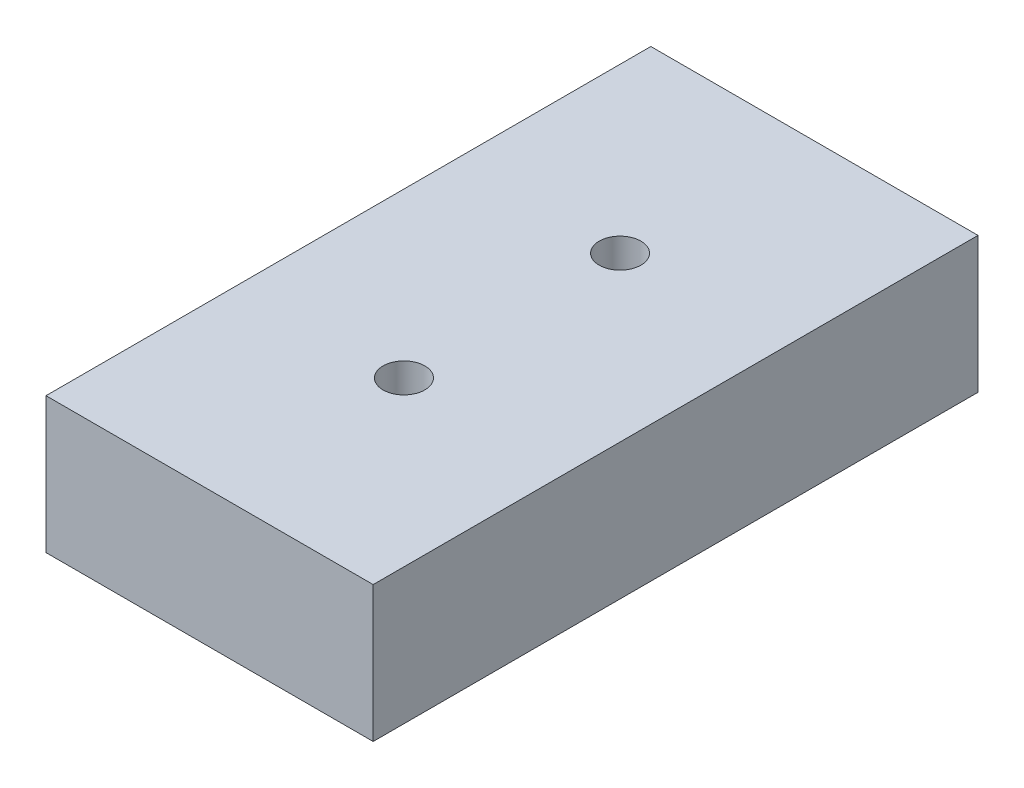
ISO-10303-21;
HEADER;
FILE_DESCRIPTION(('STEP AP214'),'2;1');
FILE_NAME('part.step','',(''),(''),'','','');
FILE_SCHEMA(('AUTOMOTIVE_DESIGN { 1 0 10303 214 1 1 1 1 }'));
ENDSEC;
DATA;
#1=APPLICATION_CONTEXT('core data for automotive mechanical design processes');
#2=APPLICATION_PROTOCOL_DEFINITION('international standard','automotive_design',2000,#1);
#3=PRODUCT_CONTEXT('',#1,'mechanical');
#4=PRODUCT('Part','Part','',(#3));
#5=PRODUCT_RELATED_PRODUCT_CATEGORY('part','',(#4));
#6=PRODUCT_DEFINITION_FORMATION('','',#4);
#7=PRODUCT_DEFINITION_CONTEXT('part definition',#1,'design');
#8=PRODUCT_DEFINITION('design','',#6,#7);
#9=PRODUCT_DEFINITION_SHAPE('','',#8);
#10=(LENGTH_UNIT() NAMED_UNIT(*) SI_UNIT(.MILLI.,.METRE.));
#11=(NAMED_UNIT(*) PLANE_ANGLE_UNIT() SI_UNIT($,.RADIAN.));
#12=(NAMED_UNIT(*) SI_UNIT($,.STERADIAN.) SOLID_ANGLE_UNIT());
#13=UNCERTAINTY_MEASURE_WITH_UNIT(LENGTH_MEASURE(1.E-05),#10,'distance_accuracy_value','');
#14=(GEOMETRIC_REPRESENTATION_CONTEXT(3) GLOBAL_UNCERTAINTY_ASSIGNED_CONTEXT((#13)) GLOBAL_UNIT_ASSIGNED_CONTEXT((#10,
#11,#12)) REPRESENTATION_CONTEXT('',''));
#15=CARTESIAN_POINT('',(0.,0.,0.));
#16=DIRECTION('',(0.,0.,1.));
#17=DIRECTION('',(1.,0.,0.));
#18=AXIS2_PLACEMENT_3D('',#15,#16,#17);
#19=CARTESIAN_POINT('',(0.,14.,0.));
#20=DIRECTION('',(0.,1.,0.));
#21=DIRECTION('',(0.,0.,1.));
#22=AXIS2_PLACEMENT_3D('',#19,#20,#21);
#23=PLANE('',#22);
#24=CARTESIAN_POINT('',(0.,14.,-11.13));
#25=DIRECTION('',(0.,1.,0.));
#26=DIRECTION('',(0.,0.,1.));
#27=AXIS2_PLACEMENT_3D('',#24,#25,#26);
#28=CIRCLE('',#27,2.15);
#29=CARTESIAN_POINT('',(0.,14.,-8.98));
#30=VERTEX_POINT('',#29);
#31=EDGE_CURVE('E100',#30,#30,#28,.T.);
#32=ORIENTED_EDGE('',*,*,#31,.F.);
#33=EDGE_LOOP('',(#32));
#34=FACE_BOUND('',#33,.T.);
#35=DIRECTION('',(0.,0.,-1.));
#36=VECTOR('',#35,1.);
#37=CARTESIAN_POINT('',(16.85,14.,-31.15));
#38=LINE('',#37,#36);
#39=CARTESIAN_POINT('',(16.85,14.,31.15));
#40=VERTEX_POINT('',#39);
#41=CARTESIAN_POINT('',(16.85,14.,-31.15));
#42=VERTEX_POINT('',#41);
#43=EDGE_CURVE('E85',#40,#42,#38,.T.);
#44=ORIENTED_EDGE('',*,*,#43,.T.);
#45=DIRECTION('',(-1.,0.,0.));
#46=VECTOR('',#45,1.);
#47=CARTESIAN_POINT('',(-16.85,14.,-31.15));
#48=LINE('',#47,#46);
#49=CARTESIAN_POINT('',(-16.85,14.,-31.15));
#50=VERTEX_POINT('',#49);
#51=EDGE_CURVE('E80',#42,#50,#48,.T.);
#52=ORIENTED_EDGE('',*,*,#51,.T.);
#53=DIRECTION('',(0.,0.,1.));
#54=VECTOR('',#53,1.);
#55=CARTESIAN_POINT('',(-16.85,14.,-31.15));
#56=LINE('',#55,#54);
#57=CARTESIAN_POINT('',(-16.85,14.,31.15));
#58=VERTEX_POINT('',#57);
#59=EDGE_CURVE('E83',#50,#58,#56,.T.);
#60=ORIENTED_EDGE('',*,*,#59,.T.);
#61=DIRECTION('',(1.,0.,0.));
#62=VECTOR('',#61,1.);
#63=CARTESIAN_POINT('',(-16.85,14.,31.15));
#64=LINE('',#63,#62);
#65=EDGE_CURVE('E50',#58,#40,#64,.T.);
#66=ORIENTED_EDGE('',*,*,#65,.T.);
#67=EDGE_LOOP('',(#44,#52,#60,#66));
#68=FACE_BOUND('',#67,.T.);
#69=CARTESIAN_POINT('',(0.,14.,11.13));
#70=DIRECTION('',(0.,1.,0.));
#71=DIRECTION('',(0.,0.,1.));
#72=AXIS2_PLACEMENT_3D('',#69,#70,#71);
#73=CIRCLE('',#72,2.15);
#74=CARTESIAN_POINT('',(0.,14.,13.28));
#75=VERTEX_POINT('',#74);
#76=EDGE_CURVE('E115',#75,#75,#73,.T.);
#77=ORIENTED_EDGE('',*,*,#76,.F.);
#78=EDGE_LOOP('',(#77));
#79=FACE_BOUND('',#78,.T.);
#80=ADVANCED_FACE('F33',(#34,#68,#79),#23,.T.);
#81=CARTESIAN_POINT('',(0.,0.,0.));
#82=DIRECTION('',(0.,1.,0.));
#83=DIRECTION('',(0.,0.,1.));
#84=AXIS2_PLACEMENT_3D('',#81,#82,#83);
#85=PLANE('',#84);
#86=DIRECTION('',(0.,0.,-1.));
#87=VECTOR('',#86,1.);
#88=CARTESIAN_POINT('',(16.85,0.,-31.15));
#89=LINE('',#88,#87);
#90=CARTESIAN_POINT('',(16.85,0.,31.15));
#91=VERTEX_POINT('',#90);
#92=CARTESIAN_POINT('',(16.85,0.,-31.15));
#93=VERTEX_POINT('',#92);
#94=EDGE_CURVE('E97',#91,#93,#89,.T.);
#95=ORIENTED_EDGE('',*,*,#94,.F.);
#96=DIRECTION('',(1.,0.,0.));
#97=VECTOR('',#96,1.);
#98=CARTESIAN_POINT('',(-16.85,0.,31.15));
#99=LINE('',#98,#97);
#100=CARTESIAN_POINT('',(-16.85,0.,31.15));
#101=VERTEX_POINT('',#100);
#102=EDGE_CURVE('E73',#101,#91,#99,.T.);
#103=ORIENTED_EDGE('',*,*,#102,.F.);
#104=DIRECTION('',(0.,0.,1.));
#105=VECTOR('',#104,1.);
#106=CARTESIAN_POINT('',(-16.85,0.,-31.15));
#107=LINE('',#106,#105);
#108=CARTESIAN_POINT('',(-16.85,0.,-31.15));
#109=VERTEX_POINT('',#108);
#110=EDGE_CURVE('E67',#109,#101,#107,.T.);
#111=ORIENTED_EDGE('',*,*,#110,.F.);
#112=DIRECTION('',(-1.,0.,0.));
#113=VECTOR('',#112,1.);
#114=CARTESIAN_POINT('',(-16.85,0.,-31.15));
#115=LINE('',#114,#113);
#116=EDGE_CURVE('E89',#93,#109,#115,.T.);
#117=ORIENTED_EDGE('',*,*,#116,.F.);
#118=EDGE_LOOP('',(#95,#103,#111,#117));
#119=FACE_BOUND('',#118,.T.);
#120=CARTESIAN_POINT('',(0.,0.,-11.13));
#121=DIRECTION('',(0.,1.,0.));
#122=DIRECTION('',(0.,0.,1.));
#123=AXIS2_PLACEMENT_3D('',#120,#121,#122);
#124=CIRCLE('',#123,2.15);
#125=CARTESIAN_POINT('',(0.,0.,-8.98));
#126=VERTEX_POINT('',#125);
#127=EDGE_CURVE('E112',#126,#126,#124,.T.);
#128=ORIENTED_EDGE('',*,*,#127,.T.);
#129=EDGE_LOOP('',(#128));
#130=FACE_BOUND('',#129,.T.);
#131=CARTESIAN_POINT('',(0.,0.,11.13));
#132=DIRECTION('',(0.,1.,0.));
#133=DIRECTION('',(0.,0.,1.));
#134=AXIS2_PLACEMENT_3D('',#131,#132,#133);
#135=CIRCLE('',#134,2.15);
#136=CARTESIAN_POINT('',(0.,0.,13.28));
#137=VERTEX_POINT('',#136);
#138=EDGE_CURVE('E118',#137,#137,#135,.T.);
#139=ORIENTED_EDGE('',*,*,#138,.T.);
#140=EDGE_LOOP('',(#139));
#141=FACE_BOUND('',#140,.T.);
#142=ADVANCED_FACE('F108',(#119,#130,#141),#85,.F.);
#143=CARTESIAN_POINT('',(16.85,14.,-31.15));
#144=DIRECTION('',(-1.,0.,0.));
#145=DIRECTION('',(0.,0.,1.));
#146=AXIS2_PLACEMENT_3D('',#143,#144,#145);
#147=PLANE('',#146);
#148=ORIENTED_EDGE('',*,*,#94,.T.);
#149=DIRECTION('',(0.,-1.,0.));
#150=VECTOR('',#149,1.);
#151=CARTESIAN_POINT('',(16.85,14.,-31.15));
#152=LINE('',#151,#150);
#153=EDGE_CURVE('E11',#42,#93,#152,.T.);
#154=ORIENTED_EDGE('',*,*,#153,.F.);
#155=ORIENTED_EDGE('',*,*,#43,.F.);
#156=DIRECTION('',(0.,-1.,0.));
#157=VECTOR('',#156,1.);
#158=CARTESIAN_POINT('',(16.85,14.,31.15));
#159=LINE('',#158,#157);
#160=EDGE_CURVE('E93',#40,#91,#159,.T.);
#161=ORIENTED_EDGE('',*,*,#160,.T.);
#162=EDGE_LOOP('',(#148,#154,#155,#161));
#163=FACE_BOUND('',#162,.T.);
#164=ADVANCED_FACE('F35',(#163),#147,.F.);
#165=CARTESIAN_POINT('',(-16.85,14.,-31.15));
#166=DIRECTION('',(0.,0.,1.));
#167=DIRECTION('',(1.,0.,0.));
#168=AXIS2_PLACEMENT_3D('',#165,#166,#167);
#169=PLANE('',#168);
#170=ORIENTED_EDGE('',*,*,#116,.T.);
#171=DIRECTION('',(0.,-1.,0.));
#172=VECTOR('',#171,1.);
#173=CARTESIAN_POINT('',(-16.85,14.,-31.15));
#174=LINE('',#173,#172);
#175=EDGE_CURVE('E42',#50,#109,#174,.T.);
#176=ORIENTED_EDGE('',*,*,#175,.F.);
#177=ORIENTED_EDGE('',*,*,#51,.F.);
#178=ORIENTED_EDGE('',*,*,#153,.T.);
#179=EDGE_LOOP('',(#170,#176,#177,#178));
#180=FACE_BOUND('',#179,.T.);
#181=ADVANCED_FACE('F88',(#180),#169,.F.);
#182=CARTESIAN_POINT('',(-16.85,14.,-31.15));
#183=DIRECTION('',(1.,0.,0.));
#184=DIRECTION('',(0.,0.,-1.));
#185=AXIS2_PLACEMENT_3D('',#182,#183,#184);
#186=PLANE('',#185);
#187=ORIENTED_EDGE('',*,*,#110,.T.);
#188=DIRECTION('',(0.,-1.,0.));
#189=VECTOR('',#188,1.);
#190=CARTESIAN_POINT('',(-16.85,14.,31.15));
#191=LINE('',#190,#189);
#192=EDGE_CURVE('E90',#58,#101,#191,.T.);
#193=ORIENTED_EDGE('',*,*,#192,.F.);
#194=ORIENTED_EDGE('',*,*,#59,.F.);
#195=ORIENTED_EDGE('',*,*,#175,.T.);
#196=EDGE_LOOP('',(#187,#193,#194,#195));
#197=FACE_BOUND('',#196,.T.);
#198=ADVANCED_FACE('F91',(#197),#186,.F.);
#199=CARTESIAN_POINT('',(-16.85,14.,31.15));
#200=DIRECTION('',(0.,0.,-1.));
#201=DIRECTION('',(-1.,0.,0.));
#202=AXIS2_PLACEMENT_3D('',#199,#200,#201);
#203=PLANE('',#202);
#204=ORIENTED_EDGE('',*,*,#102,.T.);
#205=ORIENTED_EDGE('',*,*,#160,.F.);
#206=ORIENTED_EDGE('',*,*,#65,.F.);
#207=ORIENTED_EDGE('',*,*,#192,.T.);
#208=EDGE_LOOP('',(#204,#205,#206,#207));
#209=FACE_BOUND('',#208,.T.);
#210=ADVANCED_FACE('F105',(#209),#203,.F.);
#211=CARTESIAN_POINT('',(0.,14.,-11.13));
#212=DIRECTION('',(0.,-1.,0.));
#213=DIRECTION('',(0.,0.,-1.));
#214=AXIS2_PLACEMENT_3D('',#211,#212,#213);
#215=CYLINDRICAL_SURFACE('',#214,2.15);
#216=ORIENTED_EDGE('',*,*,#31,.T.);
#217=EDGE_LOOP('',(#216));
#218=FACE_BOUND('',#217,.T.);
#219=ORIENTED_EDGE('',*,*,#127,.F.);
#220=EDGE_LOOP('',(#219));
#221=FACE_BOUND('',#220,.T.);
#222=ADVANCED_FACE('F135',(#218,#221),#215,.F.);
#223=CARTESIAN_POINT('',(0.,14.,11.13));
#224=DIRECTION('',(0.,-1.,0.));
#225=DIRECTION('',(0.,0.,-1.));
#226=AXIS2_PLACEMENT_3D('',#223,#224,#225);
#227=CYLINDRICAL_SURFACE('',#226,2.15);
#228=ORIENTED_EDGE('',*,*,#76,.T.);
#229=EDGE_LOOP('',(#228));
#230=FACE_BOUND('',#229,.T.);
#231=ORIENTED_EDGE('',*,*,#138,.F.);
#232=EDGE_LOOP('',(#231));
#233=FACE_BOUND('',#232,.T.);
#234=ADVANCED_FACE('F124',(#230,#233),#227,.F.);
#235=CLOSED_SHELL('',(#80,#142,#164,#181,#198,#210,#222,#234));
#236=MANIFOLD_SOLID_BREP('B2',#235);
#237=ADVANCED_BREP_SHAPE_REPRESENTATION('',(#18,#236),#14);
#238=SHAPE_DEFINITION_REPRESENTATION(#9,#237);
ENDSEC;
END-ISO-10303-21;
